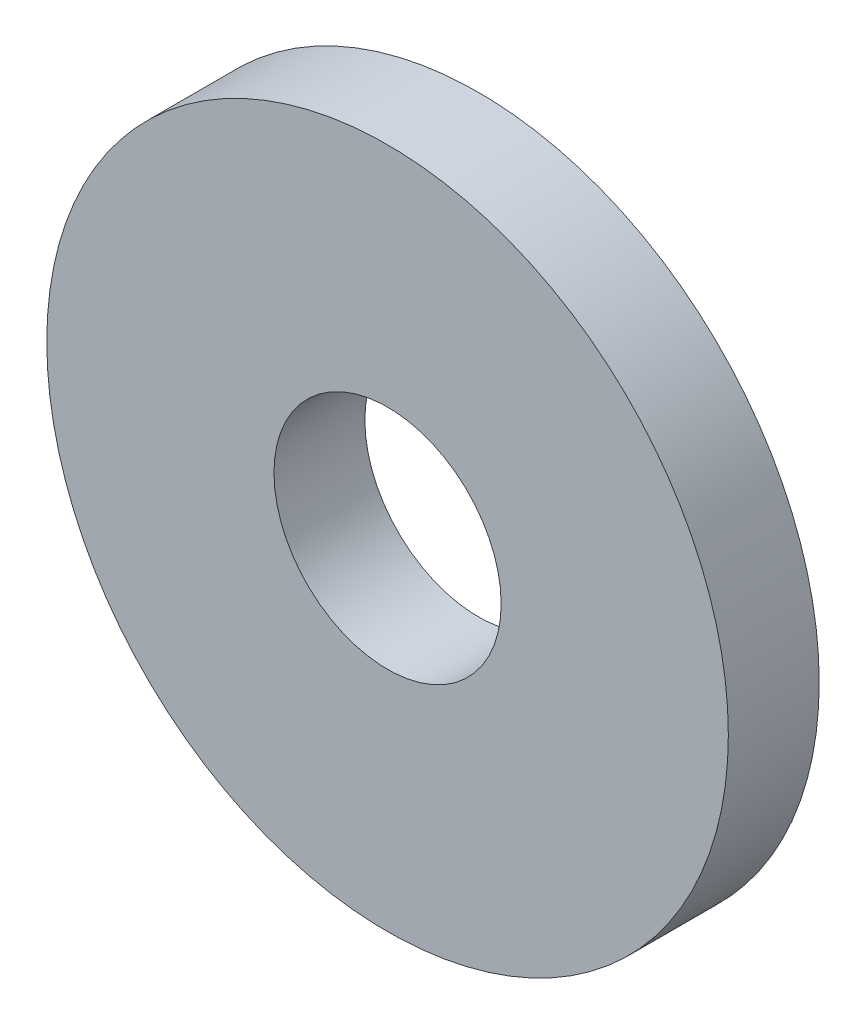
from build123d import *

# Parameters (mm, degrees)
SKETCH1_R           = 9.525
SKETCH1_R_2         = 3.175
BOSS_EXTRUDE1_DEPTH = 2.54


with BuildPart() as part:
    # Sketch1 → Boss-Extrude1 (new body)
    with BuildSketch(Plane.XY):
        Circle(SKETCH1_R)
        Circle(SKETCH1_R_2, mode=Mode.SUBTRACT)
    extrude(amount=BOSS_EXTRUDE1_DEPTH)


solid = part.part
